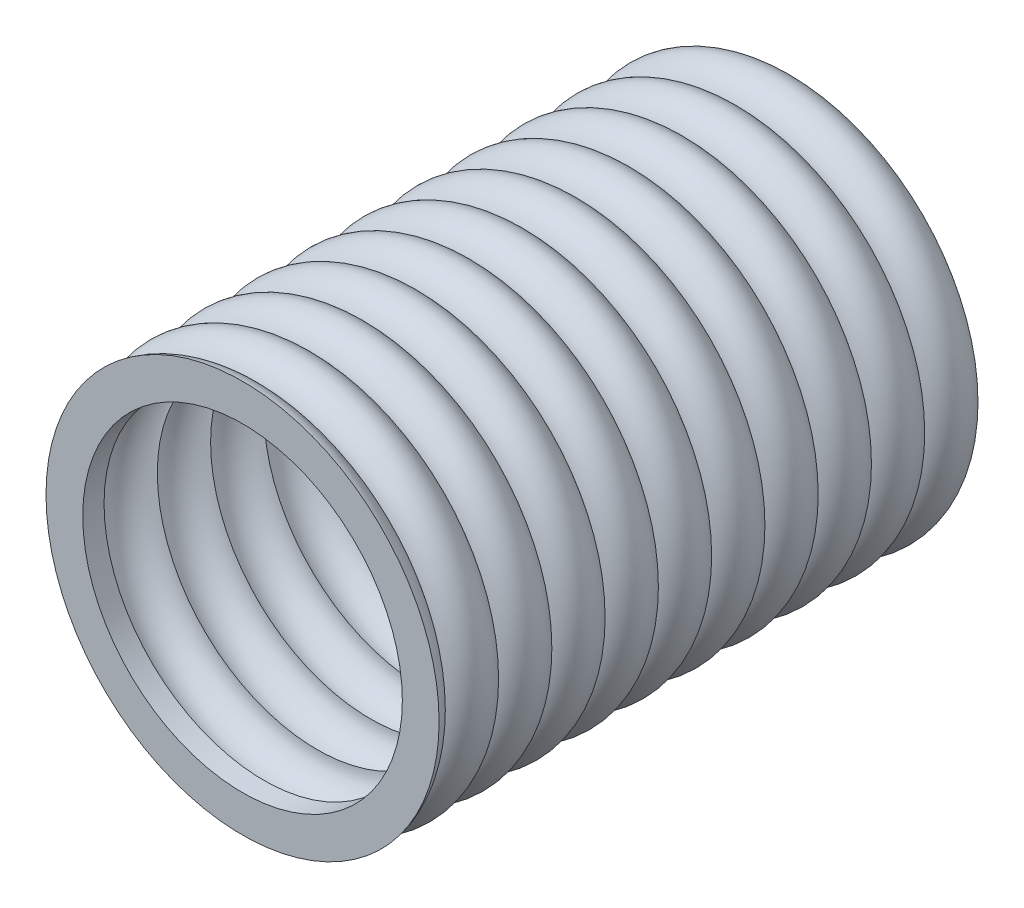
ISO-10303-21;
HEADER;
FILE_DESCRIPTION(('STEP AP214'),'2;1');
FILE_NAME('part.step','',(''),(''),'','','');
FILE_SCHEMA(('AUTOMOTIVE_DESIGN { 1 0 10303 214 1 1 1 1 }'));
ENDSEC;
DATA;
#1=APPLICATION_CONTEXT('core data for automotive mechanical design processes');
#2=APPLICATION_PROTOCOL_DEFINITION('international standard','automotive_design',2000,#1);
#3=PRODUCT_CONTEXT('',#1,'mechanical');
#4=PRODUCT('Part','Part','',(#3));
#5=PRODUCT_RELATED_PRODUCT_CATEGORY('part','',(#4));
#6=PRODUCT_DEFINITION_FORMATION('','',#4);
#7=PRODUCT_DEFINITION_CONTEXT('part definition',#1,'design');
#8=PRODUCT_DEFINITION('design','',#6,#7);
#9=PRODUCT_DEFINITION_SHAPE('','',#8);
#10=(LENGTH_UNIT() NAMED_UNIT(*) SI_UNIT(.MILLI.,.METRE.));
#11=(NAMED_UNIT(*) PLANE_ANGLE_UNIT() SI_UNIT($,.RADIAN.));
#12=(NAMED_UNIT(*) SI_UNIT($,.STERADIAN.) SOLID_ANGLE_UNIT());
#13=UNCERTAINTY_MEASURE_WITH_UNIT(LENGTH_MEASURE(1.E-05),#10,'distance_accuracy_value','');
#14=(GEOMETRIC_REPRESENTATION_CONTEXT(3) GLOBAL_UNCERTAINTY_ASSIGNED_CONTEXT((#13)) GLOBAL_UNIT_ASSIGNED_CONTEXT((#10,
#11,#12)) REPRESENTATION_CONTEXT('',''));
#15=CARTESIAN_POINT('',(0.,0.,0.));
#16=DIRECTION('',(0.,0.,1.));
#17=DIRECTION('',(1.,0.,0.));
#18=AXIS2_PLACEMENT_3D('',#15,#16,#17);
#19=CARTESIAN_POINT('',(0.,0.,33.0199999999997));
#20=DIRECTION('',(0.,0.,-0.999999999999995));
#21=DIRECTION('',(-1.00000000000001,0.,0.));
#22=AXIS2_PLACEMENT_3D('',#19,#20,#21);
#23=CYLINDRICAL_SURFACE('',#22,9.525);
#24=CARTESIAN_POINT('',(0.,0.,33.0199999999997));
#25=DIRECTION('',(0.,0.,0.999999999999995));
#26=DIRECTION('',(1.00000000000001,0.,0.));
#27=AXIS2_PLACEMENT_3D('',#24,#25,#26);
#28=CIRCLE('',#27,9.525);
#29=CARTESIAN_POINT('',(-9.52500000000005,0.,33.0199999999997));
#30=VERTEX_POINT('',#29);
#31=EDGE_CURVE('E12',#30,#30,#28,.T.);
#32=CARTESIAN_POINT('',(0.,0.,31.7499999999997));
#33=DIRECTION('',(0.,0.,-0.999999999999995));
#34=DIRECTION('',(-1.00000000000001,0.,0.));
#35=AXIS2_PLACEMENT_3D('',#32,#33,#34);
#36=CIRCLE('',#35,9.525);
#37=CARTESIAN_POINT('',(-9.52500000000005,0.,31.7499999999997));
#38=VERTEX_POINT('',#37);
#39=EDGE_CURVE('E121',#38,#38,#36,.T.);
#40=CARTESIAN_POINT('',(-9.52500000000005,0.,33.0199999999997));
#41=CARTESIAN_POINT('',(-9.52500000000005,0.,33.006770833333));
#42=CARTESIAN_POINT('',(-9.52500000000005,0.,32.9935416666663));
#43=CARTESIAN_POINT('',(-9.52500000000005,0.,32.967083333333));
#44=CARTESIAN_POINT('',(-9.52500000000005,0.,32.9538541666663));
#45=CARTESIAN_POINT('',(-9.52500000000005,0.,32.927395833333));
#46=CARTESIAN_POINT('',(-9.52500000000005,0.,32.9141666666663));
#47=CARTESIAN_POINT('',(-9.52500000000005,0.,32.887708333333));
#48=CARTESIAN_POINT('',(-9.52500000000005,0.,32.8744791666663));
#49=CARTESIAN_POINT('',(-9.52500000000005,0.,32.848020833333));
#50=CARTESIAN_POINT('',(-9.52500000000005,0.,32.8347916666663));
#51=CARTESIAN_POINT('',(-9.52500000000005,0.,32.808333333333));
#52=CARTESIAN_POINT('',(-9.52500000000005,0.,32.7951041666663));
#53=CARTESIAN_POINT('',(-9.52500000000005,0.,32.768645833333));
#54=CARTESIAN_POINT('',(-9.52500000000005,0.,32.7554166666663));
#55=CARTESIAN_POINT('',(-9.52500000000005,0.,32.728958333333));
#56=CARTESIAN_POINT('',(-9.52500000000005,0.,32.7157291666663));
#57=CARTESIAN_POINT('',(-9.52500000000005,0.,32.689270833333));
#58=CARTESIAN_POINT('',(-9.52500000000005,0.,32.6760416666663));
#59=CARTESIAN_POINT('',(-9.52500000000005,0.,32.649583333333));
#60=CARTESIAN_POINT('',(-9.52500000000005,0.,32.6363541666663));
#61=CARTESIAN_POINT('',(-9.52500000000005,0.,32.609895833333));
#62=CARTESIAN_POINT('',(-9.52500000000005,0.,32.5966666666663));
#63=CARTESIAN_POINT('',(-9.52500000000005,0.,32.570208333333));
#64=CARTESIAN_POINT('',(-9.52500000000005,0.,32.5569791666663));
#65=CARTESIAN_POINT('',(-9.52500000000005,0.,32.530520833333));
#66=CARTESIAN_POINT('',(-9.52500000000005,0.,32.5172916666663));
#67=CARTESIAN_POINT('',(-9.52500000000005,0.,32.490833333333));
#68=CARTESIAN_POINT('',(-9.52500000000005,0.,32.4776041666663));
#69=CARTESIAN_POINT('',(-9.52500000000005,0.,32.451145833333));
#70=CARTESIAN_POINT('',(-9.52500000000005,0.,32.4379166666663));
#71=CARTESIAN_POINT('',(-9.52500000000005,0.,32.411458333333));
#72=CARTESIAN_POINT('',(-9.52500000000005,0.,32.3982291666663));
#73=CARTESIAN_POINT('',(-9.52500000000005,0.,32.371770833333));
#74=CARTESIAN_POINT('',(-9.52500000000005,0.,32.3585416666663));
#75=CARTESIAN_POINT('',(-9.52500000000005,0.,32.332083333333));
#76=CARTESIAN_POINT('',(-9.52500000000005,0.,32.3188541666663));
#77=CARTESIAN_POINT('',(-9.52500000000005,0.,32.292395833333));
#78=CARTESIAN_POINT('',(-9.52500000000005,0.,32.2791666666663));
#79=CARTESIAN_POINT('',(-9.52500000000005,0.,32.252708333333));
#80=CARTESIAN_POINT('',(-9.52500000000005,0.,32.2394791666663));
#81=CARTESIAN_POINT('',(-9.52500000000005,0.,32.213020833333));
#82=CARTESIAN_POINT('',(-9.52500000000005,0.,32.1997916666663));
#83=CARTESIAN_POINT('',(-9.52500000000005,0.,32.173333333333));
#84=CARTESIAN_POINT('',(-9.52500000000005,0.,32.1601041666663));
#85=CARTESIAN_POINT('',(-9.52500000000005,0.,32.133645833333));
#86=CARTESIAN_POINT('',(-9.52500000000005,0.,32.1204166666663));
#87=CARTESIAN_POINT('',(-9.52500000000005,0.,32.093958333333));
#88=CARTESIAN_POINT('',(-9.52500000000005,0.,32.0807291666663));
#89=CARTESIAN_POINT('',(-9.52500000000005,0.,32.054270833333));
#90=CARTESIAN_POINT('',(-9.52500000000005,0.,32.0410416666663));
#91=CARTESIAN_POINT('',(-9.52500000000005,0.,32.014583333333));
#92=CARTESIAN_POINT('',(-9.52500000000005,0.,32.0013541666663));
#93=CARTESIAN_POINT('',(-9.52500000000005,0.,31.974895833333));
#94=CARTESIAN_POINT('',(-9.52500000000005,0.,31.9616666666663));
#95=CARTESIAN_POINT('',(-9.52500000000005,0.,31.935208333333));
#96=CARTESIAN_POINT('',(-9.52500000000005,0.,31.9219791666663));
#97=CARTESIAN_POINT('',(-9.52500000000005,0.,31.895520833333));
#98=CARTESIAN_POINT('',(-9.52500000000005,0.,31.8822916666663));
#99=CARTESIAN_POINT('',(-9.52500000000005,0.,31.855833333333));
#100=CARTESIAN_POINT('',(-9.52500000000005,0.,31.8426041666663));
#101=CARTESIAN_POINT('',(-9.52500000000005,0.,31.816145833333));
#102=CARTESIAN_POINT('',(-9.52500000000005,0.,31.8029166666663));
#103=CARTESIAN_POINT('',(-9.52500000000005,0.,31.776458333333));
#104=CARTESIAN_POINT('',(-9.52500000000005,0.,31.7632291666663));
#105=CARTESIAN_POINT('',(-9.52500000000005,0.,31.7499999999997));
#106=B_SPLINE_CURVE_WITH_KNOTS('',3,(#40,#41,#42,#43,#44,#45,#46,#47,#48,#49,#50,#51,#52,#53,
#54,#55,#56,#57,#58,#59,#60,#61,#62,#63,#64,#65,#66,#67,#68,#69,#70,#71,#72,#73,#74,#75,#76,#77,
#78,#79,#80,#81,#82,#83,#84,#85,#86,#87,#88,#89,#90,#91,#92,#93,#94,#95,#96,#97,#98,#99,#100,
#101,#102,#103,#104,#105),.UNSPECIFIED.,.F.,.F.,(4,2,2,2,2,2,2,2,2,2,2,2,2,2,2,2,2,2,2,2,2,2,2,
2,2,2,2,2,2,2,2,2,4),(0.,0.0396874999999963,0.0793749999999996,0.119062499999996,
0.158749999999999,0.198437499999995,0.238124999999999,0.277812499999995,0.317499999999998,
0.357187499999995,0.396874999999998,0.436562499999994,0.476249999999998,0.515937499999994,
0.555624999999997,0.595312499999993,0.634999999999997,0.6746875,0.714374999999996,0.7540625,
0.793749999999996,0.833437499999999,0.873124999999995,0.912812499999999,0.952499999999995,
0.992187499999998,1.03187499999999,1.0715625,1.11124999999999,1.1509375,1.19062499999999,
1.2303125,1.26999999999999),.UNSPECIFIED.);
#107=EDGE_CURVE('BSEAM44',#30,#38,#106,.T.);
#108=ORIENTED_EDGE('',*,*,#31,.T.);
#109=ORIENTED_EDGE('',*,*,#39,.T.);
#110=ORIENTED_EDGE('',*,*,#107,.T.);
#111=ORIENTED_EDGE('',*,*,#107,.F.);
#112=EDGE_LOOP('',(#108,#110,#109,#111));
#113=FACE_BOUND('',#112,.T.);
#114=ADVANCED_FACE('F44',(#113),#23,.F.);
#115=CARTESIAN_POINT('',(0.,0.,33.0199999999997));
#116=DIRECTION('',(0.,0.,0.999999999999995));
#117=DIRECTION('',(1.00000000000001,0.,0.));
#118=AXIS2_PLACEMENT_3D('',#115,#116,#117);
#119=PLANE('',#118);
#120=ORIENTED_EDGE('',*,*,#31,.F.);
#121=EDGE_LOOP('',(#120));
#122=FACE_BOUND('',#121,.T.);
#123=CARTESIAN_POINT('',(0.,0.,33.0199999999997));
#124=DIRECTION('',(0.,0.,0.999999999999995));
#125=DIRECTION('',(1.00000000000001,0.,0.));
#126=AXIS2_PLACEMENT_3D('',#123,#124,#125);
#127=CIRCLE('',#126,11.7154259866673);
#128=CARTESIAN_POINT('',(11.7154259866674,0.,33.0199999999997));
#129=VERTEX_POINT('',#128);
#130=EDGE_CURVE('E85',#129,#129,#127,.T.);
#131=ORIENTED_EDGE('',*,*,#130,.T.);
#132=EDGE_LOOP('',(#131));
#133=FACE_BOUND('',#132,.T.);
#134=ADVANCED_FACE('F138',(#122,#133),#119,.T.);
#135=CARTESIAN_POINT('',(0.,0.,0.));
#136=DIRECTION('',(0.,0.,0.999999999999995));
#137=DIRECTION('',(1.00000000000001,0.,0.));
#138=AXIS2_PLACEMENT_3D('',#135,#136,#137);
#139=PLANE('',#138);
#140=CARTESIAN_POINT('',(0.,0.,0.));
#141=DIRECTION('',(0.,0.,-0.999999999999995));
#142=DIRECTION('',(-1.00000000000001,0.,0.));
#143=AXIS2_PLACEMENT_3D('',#140,#141,#142);
#144=CIRCLE('',#143,10.16);
#145=CARTESIAN_POINT('',(-10.1600000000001,0.,0.));
#146=VERTEX_POINT('',#145);
#147=EDGE_CURVE('E51',#146,#146,#144,.T.);
#148=ORIENTED_EDGE('',*,*,#147,.T.);
#149=EDGE_LOOP('',(#148));
#150=FACE_BOUND('',#149,.T.);
#151=CARTESIAN_POINT('',(0.,0.,0.));
#152=DIRECTION('',(0.,0.,-0.999999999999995));
#153=DIRECTION('',(-1.00000000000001,0.,0.));
#154=AXIS2_PLACEMENT_3D('',#151,#152,#153);
#155=CIRCLE('',#154,9.525);
#156=CARTESIAN_POINT('',(-9.52500000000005,0.,0.));
#157=VERTEX_POINT('',#156);
#158=EDGE_CURVE('E91',#157,#157,#155,.T.);
#159=ORIENTED_EDGE('',*,*,#158,.F.);
#160=EDGE_LOOP('',(#159));
#161=FACE_BOUND('',#160,.T.);
#162=ADVANCED_FACE('F46',(#150,#161),#139,.F.);
#163=CARTESIAN_POINT('',(0.,0.,1.58749999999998));
#164=DIRECTION('',(0.,0.,-0.999999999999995));
#165=DIRECTION('',(-1.00000000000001,0.,0.));
#166=AXIS2_PLACEMENT_3D('',#163,#164,#165);
#167=TOROIDAL_SURFACE('',#166,10.16,1.5875);
#168=CARTESIAN_POINT('',(0.,0.,3.17499999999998));
#169=DIRECTION('',(0.,0.,-0.999999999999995));
#170=DIRECTION('',(-1.00000000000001,0.,0.));
#171=AXIS2_PLACEMENT_3D('',#168,#169,#170);
#172=CIRCLE('',#171,10.16);
#173=CARTESIAN_POINT('',(-10.1600000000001,0.,3.17499999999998));
#174=VERTEX_POINT('',#173);
#175=EDGE_CURVE('E55',#174,#174,#172,.T.);
#176=ORIENTED_EDGE('',*,*,#175,.T.);
#177=EDGE_LOOP('',(#176));
#178=FACE_BOUND('',#177,.T.);
#179=ORIENTED_EDGE('',*,*,#147,.F.);
#180=EDGE_LOOP('',(#179));
#181=FACE_BOUND('',#180,.T.);
#182=ADVANCED_FACE('F145',(#178,#181),#167,.T.);
#183=CARTESIAN_POINT('',(0.,0.,4.76249999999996));
#184=DIRECTION('',(0.,0.,-0.999999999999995));
#185=DIRECTION('',(-1.00000000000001,0.,0.));
#186=AXIS2_PLACEMENT_3D('',#183,#184,#185);
#187=TOROIDAL_SURFACE('',#186,10.16,1.5875);
#188=CARTESIAN_POINT('',(0.,0.,6.34999999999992));
#189=DIRECTION('',(0.,0.,-0.999999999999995));
#190=DIRECTION('',(-1.00000000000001,0.,0.));
#191=AXIS2_PLACEMENT_3D('',#188,#189,#190);
#192=CIRCLE('',#191,10.16);
#193=CARTESIAN_POINT('',(-10.1600000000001,0.,6.34999999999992));
#194=VERTEX_POINT('',#193);
#195=EDGE_CURVE('E59',#194,#194,#192,.T.);
#196=ORIENTED_EDGE('',*,*,#195,.T.);
#197=EDGE_LOOP('',(#196));
#198=FACE_BOUND('',#197,.T.);
#199=ORIENTED_EDGE('',*,*,#175,.F.);
#200=EDGE_LOOP('',(#199));
#201=FACE_BOUND('',#200,.T.);
#202=ADVANCED_FACE('F148',(#198,#201),#187,.T.);
#203=CARTESIAN_POINT('',(0.,0.,7.93749999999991));
#204=DIRECTION('',(0.,0.,-0.999999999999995));
#205=DIRECTION('',(-1.00000000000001,0.,0.));
#206=AXIS2_PLACEMENT_3D('',#203,#204,#205);
#207=TOROIDAL_SURFACE('',#206,10.16,1.5875);
#208=CARTESIAN_POINT('',(0.,0.,9.52499999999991));
#209=DIRECTION('',(0.,0.,-0.999999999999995));
#210=DIRECTION('',(-1.00000000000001,0.,0.));
#211=AXIS2_PLACEMENT_3D('',#208,#209,#210);
#212=CIRCLE('',#211,10.16);
#213=CARTESIAN_POINT('',(-10.1600000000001,0.,9.52499999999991));
#214=VERTEX_POINT('',#213);
#215=EDGE_CURVE('E64',#214,#214,#212,.T.);
#216=ORIENTED_EDGE('',*,*,#215,.T.);
#217=EDGE_LOOP('',(#216));
#218=FACE_BOUND('',#217,.T.);
#219=ORIENTED_EDGE('',*,*,#195,.F.);
#220=EDGE_LOOP('',(#219));
#221=FACE_BOUND('',#220,.T.);
#222=ADVANCED_FACE('F152',(#218,#221),#207,.T.);
#223=CARTESIAN_POINT('',(0.,0.,11.1124999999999));
#224=DIRECTION('',(0.,0.,-0.999999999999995));
#225=DIRECTION('',(-1.00000000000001,0.,0.));
#226=AXIS2_PLACEMENT_3D('',#223,#224,#225);
#227=TOROIDAL_SURFACE('',#226,10.16,1.5875);
#228=CARTESIAN_POINT('',(0.,0.,12.6999999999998));
#229=DIRECTION('',(0.,0.,-0.999999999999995));
#230=DIRECTION('',(-1.00000000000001,0.,0.));
#231=AXIS2_PLACEMENT_3D('',#228,#229,#230);
#232=CIRCLE('',#231,10.16);
#233=CARTESIAN_POINT('',(-10.1600000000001,0.,12.6999999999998));
#234=VERTEX_POINT('',#233);
#235=EDGE_CURVE('E67',#234,#234,#232,.T.);
#236=ORIENTED_EDGE('',*,*,#235,.T.);
#237=EDGE_LOOP('',(#236));
#238=FACE_BOUND('',#237,.T.);
#239=ORIENTED_EDGE('',*,*,#215,.F.);
#240=EDGE_LOOP('',(#239));
#241=FACE_BOUND('',#240,.T.);
#242=ADVANCED_FACE('F156',(#238,#241),#227,.T.);
#243=CARTESIAN_POINT('',(0.,0.,14.2874999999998));
#244=DIRECTION('',(0.,0.,-0.999999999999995));
#245=DIRECTION('',(-1.00000000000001,0.,0.));
#246=AXIS2_PLACEMENT_3D('',#243,#244,#245);
#247=TOROIDAL_SURFACE('',#246,10.16,1.5875);
#248=CARTESIAN_POINT('',(0.,0.,15.8749999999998));
#249=DIRECTION('',(0.,0.,-0.999999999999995));
#250=DIRECTION('',(-1.00000000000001,0.,0.));
#251=AXIS2_PLACEMENT_3D('',#248,#249,#250);
#252=CIRCLE('',#251,10.16);
#253=CARTESIAN_POINT('',(-10.1600000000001,0.,15.8749999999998));
#254=VERTEX_POINT('',#253);
#255=EDGE_CURVE('E70',#254,#254,#252,.T.);
#256=ORIENTED_EDGE('',*,*,#255,.T.);
#257=EDGE_LOOP('',(#256));
#258=FACE_BOUND('',#257,.T.);
#259=ORIENTED_EDGE('',*,*,#235,.F.);
#260=EDGE_LOOP('',(#259));
#261=FACE_BOUND('',#260,.T.);
#262=ADVANCED_FACE('F160',(#258,#261),#247,.T.);
#263=CARTESIAN_POINT('',(0.,0.,17.4624999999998));
#264=DIRECTION('',(0.,0.,-0.999999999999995));
#265=DIRECTION('',(-1.00000000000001,0.,0.));
#266=AXIS2_PLACEMENT_3D('',#263,#264,#265);
#267=TOROIDAL_SURFACE('',#266,10.16,1.5875);
#268=CARTESIAN_POINT('',(0.,0.,19.0499999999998));
#269=DIRECTION('',(0.,0.,-0.999999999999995));
#270=DIRECTION('',(-1.00000000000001,0.,0.));
#271=AXIS2_PLACEMENT_3D('',#268,#269,#270);
#272=CIRCLE('',#271,10.16);
#273=CARTESIAN_POINT('',(-10.1600000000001,0.,19.0499999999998));
#274=VERTEX_POINT('',#273);
#275=EDGE_CURVE('E73',#274,#274,#272,.T.);
#276=ORIENTED_EDGE('',*,*,#275,.T.);
#277=EDGE_LOOP('',(#276));
#278=FACE_BOUND('',#277,.T.);
#279=ORIENTED_EDGE('',*,*,#255,.F.);
#280=EDGE_LOOP('',(#279));
#281=FACE_BOUND('',#280,.T.);
#282=ADVANCED_FACE('F164',(#278,#281),#267,.T.);
#283=CARTESIAN_POINT('',(0.,0.,20.6374999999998));
#284=DIRECTION('',(0.,0.,-0.999999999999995));
#285=DIRECTION('',(-1.00000000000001,0.,0.));
#286=AXIS2_PLACEMENT_3D('',#283,#284,#285);
#287=TOROIDAL_SURFACE('',#286,10.16,1.5875);
#288=CARTESIAN_POINT('',(0.,0.,22.2249999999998));
#289=DIRECTION('',(0.,0.,-0.999999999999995));
#290=DIRECTION('',(-1.00000000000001,0.,0.));
#291=AXIS2_PLACEMENT_3D('',#288,#289,#290);
#292=CIRCLE('',#291,10.16);
#293=CARTESIAN_POINT('',(-10.1600000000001,0.,22.2249999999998));
#294=VERTEX_POINT('',#293);
#295=EDGE_CURVE('E76',#294,#294,#292,.T.);
#296=ORIENTED_EDGE('',*,*,#295,.T.);
#297=EDGE_LOOP('',(#296));
#298=FACE_BOUND('',#297,.T.);
#299=ORIENTED_EDGE('',*,*,#275,.F.);
#300=EDGE_LOOP('',(#299));
#301=FACE_BOUND('',#300,.T.);
#302=ADVANCED_FACE('F168',(#298,#301),#287,.T.);
#303=CARTESIAN_POINT('',(0.,0.,23.8124999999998));
#304=DIRECTION('',(0.,0.,-0.999999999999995));
#305=DIRECTION('',(-1.00000000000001,0.,0.));
#306=AXIS2_PLACEMENT_3D('',#303,#304,#305);
#307=TOROIDAL_SURFACE('',#306,10.16,1.5875);
#308=CARTESIAN_POINT('',(0.,0.,25.3999999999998));
#309=DIRECTION('',(0.,0.,-0.999999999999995));
#310=DIRECTION('',(-1.00000000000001,0.,0.));
#311=AXIS2_PLACEMENT_3D('',#308,#309,#310);
#312=CIRCLE('',#311,10.16);
#313=CARTESIAN_POINT('',(-10.1600000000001,0.,25.3999999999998));
#314=VERTEX_POINT('',#313);
#315=EDGE_CURVE('E79',#314,#314,#312,.T.);
#316=ORIENTED_EDGE('',*,*,#315,.T.);
#317=EDGE_LOOP('',(#316));
#318=FACE_BOUND('',#317,.T.);
#319=ORIENTED_EDGE('',*,*,#295,.F.);
#320=EDGE_LOOP('',(#319));
#321=FACE_BOUND('',#320,.T.);
#322=ADVANCED_FACE('F172',(#318,#321),#307,.T.);
#323=CARTESIAN_POINT('',(0.,0.,26.9874999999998));
#324=DIRECTION('',(0.,0.,-0.999999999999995));
#325=DIRECTION('',(-1.00000000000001,0.,0.));
#326=AXIS2_PLACEMENT_3D('',#323,#324,#325);
#327=TOROIDAL_SURFACE('',#326,10.16,1.5875);
#328=CARTESIAN_POINT('',(0.,0.,28.5749999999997));
#329=DIRECTION('',(0.,0.,-0.999999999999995));
#330=DIRECTION('',(-1.00000000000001,0.,0.));
#331=AXIS2_PLACEMENT_3D('',#328,#329,#330);
#332=CIRCLE('',#331,10.16);
#333=CARTESIAN_POINT('',(-10.1600000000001,0.,28.5749999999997));
#334=VERTEX_POINT('',#333);
#335=EDGE_CURVE('E82',#334,#334,#332,.T.);
#336=ORIENTED_EDGE('',*,*,#335,.T.);
#337=EDGE_LOOP('',(#336));
#338=FACE_BOUND('',#337,.T.);
#339=ORIENTED_EDGE('',*,*,#315,.F.);
#340=EDGE_LOOP('',(#339));
#341=FACE_BOUND('',#340,.T.);
#342=ADVANCED_FACE('F176',(#338,#341),#327,.T.);
#343=CARTESIAN_POINT('',(0.,0.,30.1624999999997));
#344=DIRECTION('',(0.,0.,-0.999999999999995));
#345=DIRECTION('',(-1.00000000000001,0.,0.));
#346=AXIS2_PLACEMENT_3D('',#343,#344,#345);
#347=TOROIDAL_SURFACE('',#346,10.16,1.5875);
#348=CARTESIAN_POINT('',(0.,0.,31.7499999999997));
#349=DIRECTION('',(0.,0.,-0.999999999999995));
#350=DIRECTION('',(-1.00000000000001,0.,0.));
#351=AXIS2_PLACEMENT_3D('',#348,#349,#350);
#352=CIRCLE('',#351,10.16);
#353=CARTESIAN_POINT('',(-10.1600000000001,0.,31.7499999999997));
#354=VERTEX_POINT('',#353);
#355=EDGE_CURVE('E88',#354,#354,#352,.T.);
#356=ORIENTED_EDGE('',*,*,#355,.T.);
#357=EDGE_LOOP('',(#356));
#358=FACE_BOUND('',#357,.T.);
#359=ORIENTED_EDGE('',*,*,#335,.F.);
#360=EDGE_LOOP('',(#359));
#361=FACE_BOUND('',#360,.T.);
#362=ADVANCED_FACE('F180',(#358,#361),#347,.T.);
#363=CARTESIAN_POINT('',(0.,0.,33.3374999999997));
#364=DIRECTION('',(0.,0.,-0.999999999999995));
#365=DIRECTION('',(-1.00000000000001,0.,0.));
#366=AXIS2_PLACEMENT_3D('',#363,#364,#365);
#367=TOROIDAL_SURFACE('',#366,10.16,1.5875);
#368=ORIENTED_EDGE('',*,*,#130,.F.);
#369=EDGE_LOOP('',(#368));
#370=FACE_BOUND('',#369,.T.);
#371=ORIENTED_EDGE('',*,*,#355,.F.);
#372=EDGE_LOOP('',(#371));
#373=FACE_BOUND('',#372,.T.);
#374=ADVANCED_FACE('F184',(#370,#373),#367,.T.);
#375=CARTESIAN_POINT('',(0.,0.,1.58749999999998));
#376=DIRECTION('',(0.,0.,-0.999999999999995));
#377=DIRECTION('',(-1.00000000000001,0.,0.));
#378=AXIS2_PLACEMENT_3D('',#375,#376,#377);
#379=TOROIDAL_SURFACE('',#378,9.525,1.5875);
#380=ORIENTED_EDGE('',*,*,#158,.T.);
#381=EDGE_LOOP('',(#380));
#382=FACE_BOUND('',#381,.T.);
#383=CARTESIAN_POINT('',(0.,0.,3.17499999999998));
#384=DIRECTION('',(0.,0.,-0.999999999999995));
#385=DIRECTION('',(-1.00000000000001,0.,0.));
#386=AXIS2_PLACEMENT_3D('',#383,#384,#385);
#387=CIRCLE('',#386,9.525);
#388=CARTESIAN_POINT('',(-9.52500000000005,0.,3.17499999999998));
#389=VERTEX_POINT('',#388);
#390=EDGE_CURVE('E94',#389,#389,#387,.T.);
#391=ORIENTED_EDGE('',*,*,#390,.F.);
#392=EDGE_LOOP('',(#391));
#393=FACE_BOUND('',#392,.T.);
#394=ADVANCED_FACE('F188',(#382,#393),#379,.F.);
#395=CARTESIAN_POINT('',(0.,0.,4.76249999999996));
#396=DIRECTION('',(0.,0.,-0.999999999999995));
#397=DIRECTION('',(-1.00000000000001,0.,0.));
#398=AXIS2_PLACEMENT_3D('',#395,#396,#397);
#399=TOROIDAL_SURFACE('',#398,9.525,1.5875);
#400=ORIENTED_EDGE('',*,*,#390,.T.);
#401=EDGE_LOOP('',(#400));
#402=FACE_BOUND('',#401,.T.);
#403=CARTESIAN_POINT('',(0.,0.,6.34999999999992));
#404=DIRECTION('',(0.,0.,-0.999999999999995));
#405=DIRECTION('',(-1.00000000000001,0.,0.));
#406=AXIS2_PLACEMENT_3D('',#403,#404,#405);
#407=CIRCLE('',#406,9.525);
#408=CARTESIAN_POINT('',(-9.52500000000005,0.,6.34999999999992));
#409=VERTEX_POINT('',#408);
#410=EDGE_CURVE('E97',#409,#409,#407,.T.);
#411=ORIENTED_EDGE('',*,*,#410,.F.);
#412=EDGE_LOOP('',(#411));
#413=FACE_BOUND('',#412,.T.);
#414=ADVANCED_FACE('F192',(#402,#413),#399,.F.);
#415=CARTESIAN_POINT('',(0.,0.,7.93749999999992));
#416=DIRECTION('',(0.,0.,-0.999999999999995));
#417=DIRECTION('',(-1.00000000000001,0.,0.));
#418=AXIS2_PLACEMENT_3D('',#415,#416,#417);
#419=TOROIDAL_SURFACE('',#418,9.525,1.5875);
#420=ORIENTED_EDGE('',*,*,#410,.T.);
#421=EDGE_LOOP('',(#420));
#422=FACE_BOUND('',#421,.T.);
#423=CARTESIAN_POINT('',(0.,0.,9.52499999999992));
#424=DIRECTION('',(0.,0.,-0.999999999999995));
#425=DIRECTION('',(-1.00000000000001,0.,0.));
#426=AXIS2_PLACEMENT_3D('',#423,#424,#425);
#427=CIRCLE('',#426,9.525);
#428=CARTESIAN_POINT('',(-9.52500000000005,0.,9.52499999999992));
#429=VERTEX_POINT('',#428);
#430=EDGE_CURVE('E100',#429,#429,#427,.T.);
#431=ORIENTED_EDGE('',*,*,#430,.F.);
#432=EDGE_LOOP('',(#431));
#433=FACE_BOUND('',#432,.T.);
#434=ADVANCED_FACE('F196',(#422,#433),#419,.F.);
#435=CARTESIAN_POINT('',(0.,0.,11.1124999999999));
#436=DIRECTION('',(0.,0.,-0.999999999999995));
#437=DIRECTION('',(-1.00000000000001,0.,0.));
#438=AXIS2_PLACEMENT_3D('',#435,#436,#437);
#439=TOROIDAL_SURFACE('',#438,9.525,1.5875);
#440=ORIENTED_EDGE('',*,*,#430,.T.);
#441=EDGE_LOOP('',(#440));
#442=FACE_BOUND('',#441,.T.);
#443=CARTESIAN_POINT('',(0.,0.,12.6999999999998));
#444=DIRECTION('',(0.,0.,-0.999999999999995));
#445=DIRECTION('',(-1.00000000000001,0.,0.));
#446=AXIS2_PLACEMENT_3D('',#443,#444,#445);
#447=CIRCLE('',#446,9.525);
#448=CARTESIAN_POINT('',(-9.52500000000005,0.,12.6999999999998));
#449=VERTEX_POINT('',#448);
#450=EDGE_CURVE('E103',#449,#449,#447,.T.);
#451=ORIENTED_EDGE('',*,*,#450,.F.);
#452=EDGE_LOOP('',(#451));
#453=FACE_BOUND('',#452,.T.);
#454=ADVANCED_FACE('F200',(#442,#453),#439,.F.);
#455=CARTESIAN_POINT('',(0.,0.,14.2874999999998));
#456=DIRECTION('',(0.,0.,-0.999999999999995));
#457=DIRECTION('',(-1.00000000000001,0.,0.));
#458=AXIS2_PLACEMENT_3D('',#455,#456,#457);
#459=TOROIDAL_SURFACE('',#458,9.525,1.5875);
#460=ORIENTED_EDGE('',*,*,#450,.T.);
#461=EDGE_LOOP('',(#460));
#462=FACE_BOUND('',#461,.T.);
#463=CARTESIAN_POINT('',(0.,0.,15.8749999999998));
#464=DIRECTION('',(0.,0.,-0.999999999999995));
#465=DIRECTION('',(-1.00000000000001,0.,0.));
#466=AXIS2_PLACEMENT_3D('',#463,#464,#465);
#467=CIRCLE('',#466,9.525);
#468=CARTESIAN_POINT('',(-9.52500000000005,0.,15.8749999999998));
#469=VERTEX_POINT('',#468);
#470=EDGE_CURVE('E106',#469,#469,#467,.T.);
#471=ORIENTED_EDGE('',*,*,#470,.F.);
#472=EDGE_LOOP('',(#471));
#473=FACE_BOUND('',#472,.T.);
#474=ADVANCED_FACE('F204',(#462,#473),#459,.F.);
#475=CARTESIAN_POINT('',(0.,0.,17.4624999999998));
#476=DIRECTION('',(0.,0.,-0.999999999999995));
#477=DIRECTION('',(-1.00000000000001,0.,0.));
#478=AXIS2_PLACEMENT_3D('',#475,#476,#477);
#479=TOROIDAL_SURFACE('',#478,9.525,1.5875);
#480=ORIENTED_EDGE('',*,*,#470,.T.);
#481=EDGE_LOOP('',(#480));
#482=FACE_BOUND('',#481,.T.);
#483=CARTESIAN_POINT('',(0.,0.,19.0499999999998));
#484=DIRECTION('',(0.,0.,-0.999999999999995));
#485=DIRECTION('',(-1.00000000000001,0.,0.));
#486=AXIS2_PLACEMENT_3D('',#483,#484,#485);
#487=CIRCLE('',#486,9.525);
#488=CARTESIAN_POINT('',(-9.52500000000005,0.,19.0499999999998));
#489=VERTEX_POINT('',#488);
#490=EDGE_CURVE('E109',#489,#489,#487,.T.);
#491=ORIENTED_EDGE('',*,*,#490,.F.);
#492=EDGE_LOOP('',(#491));
#493=FACE_BOUND('',#492,.T.);
#494=ADVANCED_FACE('F208',(#482,#493),#479,.F.);
#495=CARTESIAN_POINT('',(0.,0.,20.6374999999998));
#496=DIRECTION('',(0.,0.,-0.999999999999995));
#497=DIRECTION('',(-1.00000000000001,0.,0.));
#498=AXIS2_PLACEMENT_3D('',#495,#496,#497);
#499=TOROIDAL_SURFACE('',#498,9.525,1.5875);
#500=ORIENTED_EDGE('',*,*,#490,.T.);
#501=EDGE_LOOP('',(#500));
#502=FACE_BOUND('',#501,.T.);
#503=CARTESIAN_POINT('',(0.,0.,22.2249999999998));
#504=DIRECTION('',(0.,0.,-0.999999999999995));
#505=DIRECTION('',(-1.00000000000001,0.,0.));
#506=AXIS2_PLACEMENT_3D('',#503,#504,#505);
#507=CIRCLE('',#506,9.525);
#508=CARTESIAN_POINT('',(-9.52500000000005,0.,22.2249999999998));
#509=VERTEX_POINT('',#508);
#510=EDGE_CURVE('E112',#509,#509,#507,.T.);
#511=ORIENTED_EDGE('',*,*,#510,.F.);
#512=EDGE_LOOP('',(#511));
#513=FACE_BOUND('',#512,.T.);
#514=ADVANCED_FACE('F212',(#502,#513),#499,.F.);
#515=CARTESIAN_POINT('',(0.,0.,23.8124999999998));
#516=DIRECTION('',(0.,0.,-0.999999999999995));
#517=DIRECTION('',(-1.00000000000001,0.,0.));
#518=AXIS2_PLACEMENT_3D('',#515,#516,#517);
#519=TOROIDAL_SURFACE('',#518,9.525,1.5875);
#520=ORIENTED_EDGE('',*,*,#510,.T.);
#521=EDGE_LOOP('',(#520));
#522=FACE_BOUND('',#521,.T.);
#523=CARTESIAN_POINT('',(0.,0.,25.3999999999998));
#524=DIRECTION('',(0.,0.,-0.999999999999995));
#525=DIRECTION('',(-1.00000000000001,0.,0.));
#526=AXIS2_PLACEMENT_3D('',#523,#524,#525);
#527=CIRCLE('',#526,9.525);
#528=CARTESIAN_POINT('',(-9.52500000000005,0.,25.3999999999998));
#529=VERTEX_POINT('',#528);
#530=EDGE_CURVE('E115',#529,#529,#527,.T.);
#531=ORIENTED_EDGE('',*,*,#530,.F.);
#532=EDGE_LOOP('',(#531));
#533=FACE_BOUND('',#532,.T.);
#534=ADVANCED_FACE('F134',(#522,#533),#519,.F.);
#535=CARTESIAN_POINT('',(0.,0.,26.9874999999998));
#536=DIRECTION('',(0.,0.,-0.999999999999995));
#537=DIRECTION('',(-1.00000000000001,0.,0.));
#538=AXIS2_PLACEMENT_3D('',#535,#536,#537);
#539=TOROIDAL_SURFACE('',#538,9.525,1.5875);
#540=ORIENTED_EDGE('',*,*,#530,.T.);
#541=EDGE_LOOP('',(#540));
#542=FACE_BOUND('',#541,.T.);
#543=CARTESIAN_POINT('',(0.,0.,28.5749999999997));
#544=DIRECTION('',(0.,0.,-0.999999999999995));
#545=DIRECTION('',(-1.00000000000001,0.,0.));
#546=AXIS2_PLACEMENT_3D('',#543,#544,#545);
#547=CIRCLE('',#546,9.525);
#548=CARTESIAN_POINT('',(-9.52500000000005,0.,28.5749999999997));
#549=VERTEX_POINT('',#548);
#550=EDGE_CURVE('E118',#549,#549,#547,.T.);
#551=ORIENTED_EDGE('',*,*,#550,.F.);
#552=EDGE_LOOP('',(#551));
#553=FACE_BOUND('',#552,.T.);
#554=ADVANCED_FACE('F128',(#542,#553),#539,.F.);
#555=CARTESIAN_POINT('',(0.,0.,30.1624999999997));
#556=DIRECTION('',(0.,0.,-0.999999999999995));
#557=DIRECTION('',(-1.00000000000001,0.,0.));
#558=AXIS2_PLACEMENT_3D('',#555,#556,#557);
#559=TOROIDAL_SURFACE('',#558,9.525,1.5875);
#560=ORIENTED_EDGE('',*,*,#550,.T.);
#561=EDGE_LOOP('',(#560));
#562=FACE_BOUND('',#561,.T.);
#563=ORIENTED_EDGE('',*,*,#39,.F.);
#564=EDGE_LOOP('',(#563));
#565=FACE_BOUND('',#564,.T.);
#566=ADVANCED_FACE('F126',(#562,#565),#559,.F.);
#567=CLOSED_SHELL('',(#114,#134,#162,#182,#202,#222,#242,#262,#282,#302,#322,#342,#362,#374,
#394,#414,#434,#454,#474,#494,#514,#534,#554,#566));
#568=MANIFOLD_SOLID_BREP('B2',#567);
#569=ADVANCED_BREP_SHAPE_REPRESENTATION('',(#18,#568),#14);
#570=SHAPE_DEFINITION_REPRESENTATION(#9,#569);
ENDSEC;
END-ISO-10303-21;
